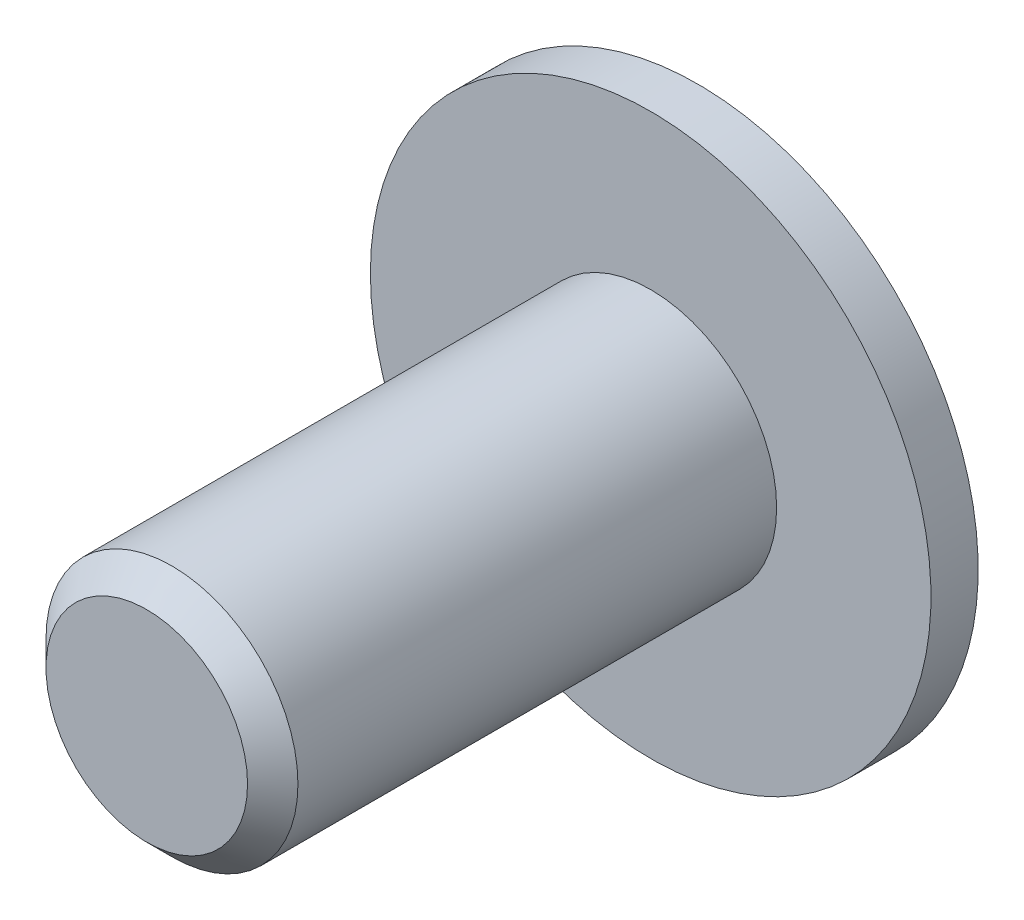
from build123d import *

# Parameters (mm, degrees)
ENLEV_MAT_EXTRU1_DEPTH = 2.6
ESQUISSE3_W            = 4
ESQUISSE3_H            = 16
CHANFREIN1_SIZE        = 0.8


with BuildPart() as part:
    # Esquisse1 → Base-R_volution (revolve)
    with BuildSketch(Plane(origin=(0, 0, 0), x_dir=(1, 0, 0), z_dir=(0, 1, 0)), mode=Mode.PRIVATE) as base_r_volution_sk:
        with BuildLine():
            Line((0, 0), (7, 0))
            Line((7, 0), (8.9, 0))
            Line((8.9, 0), (8.9, 1.5))
            Line((8.9, 1.5), (6.890435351, 1.5))
            ThreePointArc((6.890435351, 1.5), (5.876332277, 3.338413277), (4.064923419, 4.4))
            Line((4.064923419, 4.4), (0, 4.4))
            Line((0, 4.4), (0, 0))
        make_face()
    revolve(base_r_volution_sk.sketch.rotate(Axis((0, 0, 0), (0, 0, -1)), 180), axis=Axis((0, 0, 0), (0, 0, -1)))

    # Esquisse2 → enlev-mat-Extru1 (cut)
    with BuildSketch(Plane.XY.offset(-4.4)):
        Polygon((2.5, -1.443375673), (2.5, 1.443375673), (0, 2.886751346), (-2.5, 1.443375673), (-2.5, -1.443375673), (0, -2.886751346), align=None)
    extrude(amount=ENLEV_MAT_EXTRU1_DEPTH, mode=Mode.SUBTRACT)

    # Esquisse3 → Boss.-R_vol.1 (revolve)
    with BuildSketch(Plane(origin=(0, 0, 0), x_dir=(1, 0, 0), z_dir=(0, 1, 0)), mode=Mode.PRIVATE) as boss_r_vol_1_sk:
        with Locations((2, -8)):
            Rectangle(ESQUISSE3_W, ESQUISSE3_H)
    revolve(boss_r_vol_1_sk.sketch.rotate(Axis((0, 0, 0), (0, 0, 1)), 180), axis=Axis((0, 0, 0), (0, 0, 1)))

    # Chanfrein1
    chanfrein1_edges = [part.edges().sort_by_distance(p)[0] for p in [
        (4, 0, 16),
    ]]
    chamfer(chanfrein1_edges, length=CHANFREIN1_SIZE)


solid = part.part
